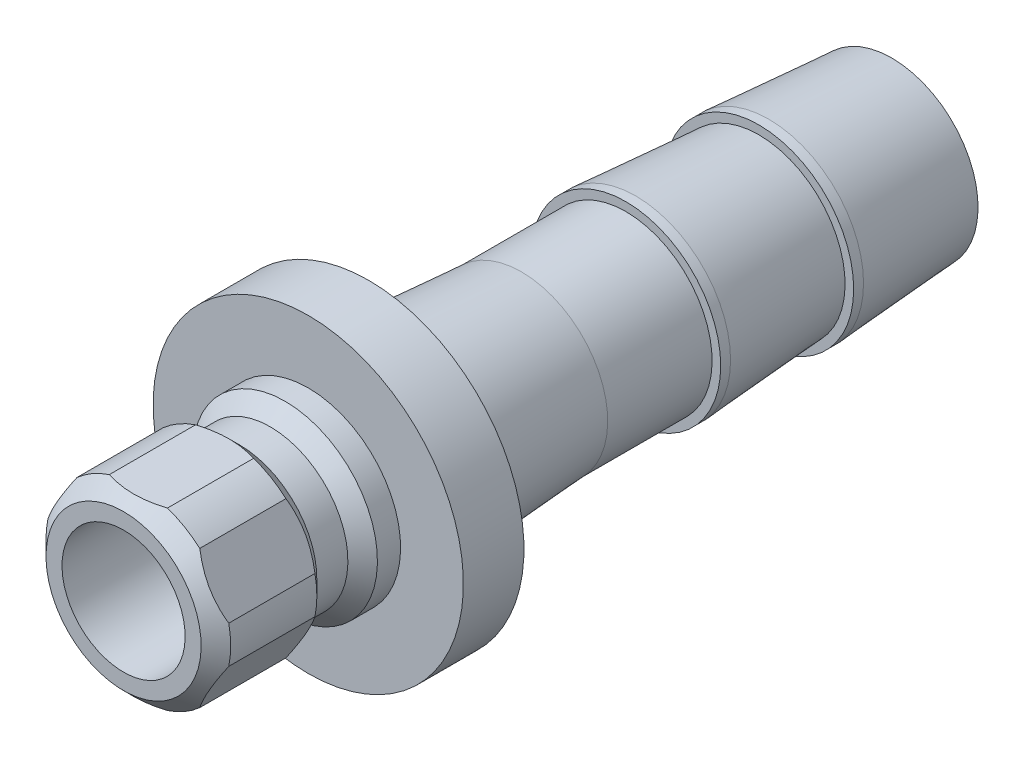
from build123d import *

# Parameters (mm, degrees)
SKETCH2_OUTSIDE_W  = 27.128
SKETCH2_OUTSIDE_H  = 27.128
CUT_EXTRUDE1_DEPTH = 6.35


with BuildPart() as part:
    # Sketch1 → Revolve1 (revolve)
    with BuildSketch(Plane(origin=(0, 0, 0), x_dir=(0, 0, -1), z_dir=(1, 0, 0))):
        Polygon((-9.525, 3.175), (-9.525, 4.0005), (-8.763, 4.7625), (-4.318, 4.7625), (-3.556, 4.0005), (-1.9558, 4.0005), (-1.1938, 4.7625), (0, 4.7625), (0, 8.001), (3.1242, 8.001), (3.1242, 4.8895), (4.6482, 4.8895), (10.9982, 4.445), (16.383, 4.445), (16.383, 4.8895), (16.891, 4.8895), (23.241, 4.445), (23.241, 4.8895), (23.749, 4.8895), (30.099, 4.445), (30.099, 3.175), align=None)
    revolve(axis=Axis((0, 0, 0), (0, 0, 1)))

    # Sketch2 outside → Cut-Extrude1 (cut)
    with BuildSketch(Plane.XY.offset(9.525)):
        Rectangle(SKETCH2_OUTSIDE_W, SKETCH2_OUTSIDE_H)
        Polygon((-2.610316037, 4.5212), (-5.220632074, 0), (-2.610316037, -4.5212), (2.610316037, -4.5212), (5.220632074, 0), (2.610316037, 4.5212), align=None, mode=Mode.SUBTRACT)
    extrude(amount=-CUT_EXTRUDE1_DEPTH, mode=Mode.SUBTRACT)


solid = part.part
